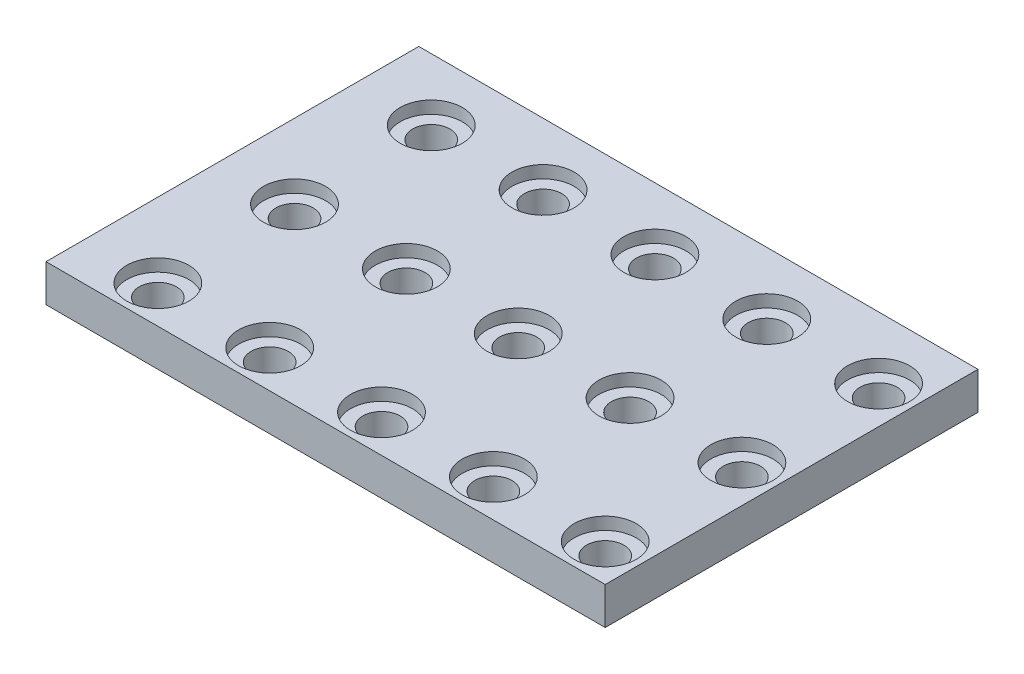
from build123d import *

# Parameters (mm, degrees)
SKETCH1_W            = 45
SKETCH1_H            = 30
EXTRUDE1_DEPTH       = 3
SKETCH7_R            = 1.5
CUT_EXTRUDE3_DEPTH   = 55.166410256
SKETCH8_R            = 2.5
CUT_EXTRUDE4_DEPTH   = 1
LPATTERN2_COUNT      = 5
LPATTERN2_PITCH      = 9
LPATTERN2_COUNT_DIR2 = 3
LPATTERN2_PITCH_DIR2 = 11


with BuildPart() as part:
    # Sketch1 → Extrude1 (new body)
    with BuildSketch(Plane(origin=(0, 0, 0), x_dir=(1, 0, 0), z_dir=(0, 1, 0))):
        with Locations((22.5, -15)):
            Rectangle(SKETCH1_W, SKETCH1_H)
    extrude(amount=EXTRUDE1_DEPTH)

    # Sketch7 → Cut-Extrude3 (cut, through all)
    with BuildSketch(Plane(origin=(0, 3, 0), x_dir=(-1, 0, 0), z_dir=(0, 1, 0))):
        with Locations(Location((-42, 27, 0), (0, 0, 90))):
            Circle(SKETCH7_R)
    cut_extrude3 = extrude(amount=-CUT_EXTRUDE3_DEPTH, mode=Mode.SUBTRACT)

    # Sketch8 → Cut-Extrude4 (cut)
    with BuildSketch(Plane(origin=(0, 3, 0), x_dir=(-1, 0, 0), z_dir=(0, 1, 0))):
        with Locations(Location((-42, 27, 0), (0, 0, 90))):
            Circle(SKETCH8_R)
    cut_extrude4 = extrude(amount=-CUT_EXTRUDE4_DEPTH, mode=Mode.SUBTRACT)

    # LPattern2: Cut-Extrude3, Cut-Extrude4 5 × 3
    with Locations(*[(-i * LPATTERN2_PITCH, 0, -j * LPATTERN2_PITCH_DIR2) for i in range(LPATTERN2_COUNT) for j in range(LPATTERN2_COUNT_DIR2) if (i, j) != (0, 0)]):
        add(cut_extrude3, mode=Mode.SUBTRACT)
        add(cut_extrude4, mode=Mode.SUBTRACT)


solid = part.part
